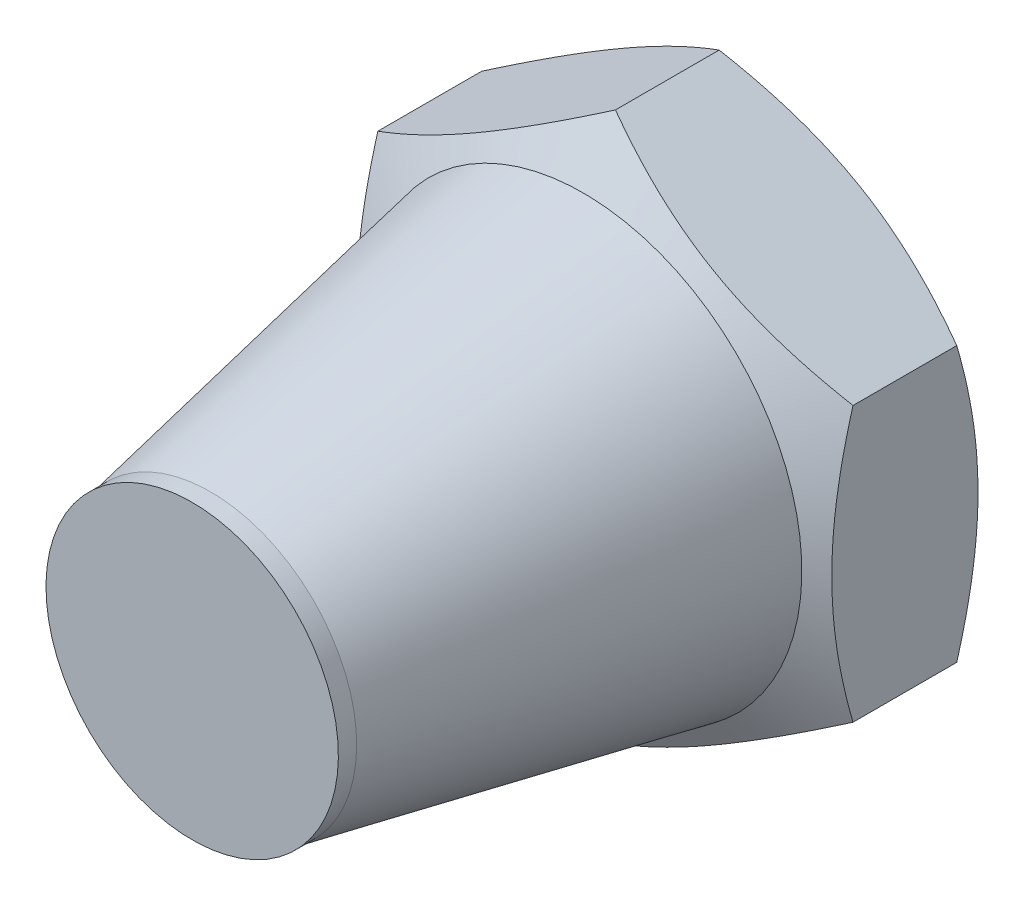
ISO-10303-21;
HEADER;
FILE_DESCRIPTION(('STEP AP214'),'2;1');
FILE_NAME('part.step','',(''),(''),'','','');
FILE_SCHEMA(('AUTOMOTIVE_DESIGN { 1 0 10303 214 1 1 1 1 }'));
ENDSEC;
DATA;
#1=APPLICATION_CONTEXT('core data for automotive mechanical design processes');
#2=APPLICATION_PROTOCOL_DEFINITION('international standard','automotive_design',2000,#1);
#3=PRODUCT_CONTEXT('',#1,'mechanical');
#4=PRODUCT('Part','Part','',(#3));
#5=PRODUCT_RELATED_PRODUCT_CATEGORY('part','',(#4));
#6=PRODUCT_DEFINITION_FORMATION('','',#4);
#7=PRODUCT_DEFINITION_CONTEXT('part definition',#1,'design');
#8=PRODUCT_DEFINITION('design','',#6,#7);
#9=PRODUCT_DEFINITION_SHAPE('','',#8);
#10=(LENGTH_UNIT() NAMED_UNIT(*) SI_UNIT(.MILLI.,.METRE.));
#11=(NAMED_UNIT(*) PLANE_ANGLE_UNIT() SI_UNIT($,.RADIAN.));
#12=(NAMED_UNIT(*) SI_UNIT($,.STERADIAN.) SOLID_ANGLE_UNIT());
#13=UNCERTAINTY_MEASURE_WITH_UNIT(LENGTH_MEASURE(1.E-05),#10,'distance_accuracy_value','');
#14=(GEOMETRIC_REPRESENTATION_CONTEXT(3) GLOBAL_UNCERTAINTY_ASSIGNED_CONTEXT((#13)) GLOBAL_UNIT_ASSIGNED_CONTEXT((#10,
#11,#12)) REPRESENTATION_CONTEXT('',''));
#15=CARTESIAN_POINT('',(0.,0.,0.));
#16=DIRECTION('',(0.,0.,1.));
#17=DIRECTION('',(1.,0.,0.));
#18=AXIS2_PLACEMENT_3D('',#15,#16,#17);
#19=CARTESIAN_POINT('',(0.,0.,2.));
#20=DIRECTION('',(0.,0.,-1.));
#21=DIRECTION('',(0.866025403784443,-0.499999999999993,0.));
#22=AXIS2_PLACEMENT_3D('',#19,#20,#21);
#23=CONICAL_SURFACE('',#22,9.9641016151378,1.0471975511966);
#24=CARTESIAN_POINT('',(0.,0.,4.3002221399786));
#25=DIRECTION('',(0.,0.,-1.));
#26=DIRECTION('',(0.866025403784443,-0.499999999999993,0.));
#27=AXIS2_PLACEMENT_3D('',#24,#25,#26);
#28=CIRCLE('',#27,5.98);
#29=CARTESIAN_POINT('',(5.17883191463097,-2.98999999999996,4.3002221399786));
#30=VERTEX_POINT('',#29);
#31=EDGE_CURVE('E274',#30,#30,#28,.T.);
#32=ORIENTED_EDGE('',*,*,#31,.T.);
#33=EDGE_LOOP('',(#32));
#34=FACE_BOUND('',#33,.T.);
#35=CARTESIAN_POINT('',(-5.50464676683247,10.6836627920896,0.813953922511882));
#36=CARTESIAN_POINT('',(-5.25856626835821,10.5415881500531,0.951906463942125));
#37=CARTESIAN_POINT('',(-5.01192350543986,10.3991888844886,1.08854446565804));
#38=CARTESIAN_POINT('',(-4.517214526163,10.1135685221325,1.35845260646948));
#39=CARTESIAN_POINT('',(-4.26914809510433,9.97034730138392,1.49172222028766));
#40=CARTESIAN_POINT('',(-3.77002670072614,9.68217942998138,1.75481910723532));
#41=CARTESIAN_POINT('',(-3.5189628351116,9.53722763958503,1.88462393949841));
#42=CARTESIAN_POINT('',(-3.01484675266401,9.2461760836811,2.13895929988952));
#43=CARTESIAN_POINT('',(-2.76179462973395,9.10007637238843,2.26349007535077));
#44=CARTESIAN_POINT('',(-2.24505569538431,8.80173700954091,2.50981565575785));
#45=CARTESIAN_POINT('',(-1.98129000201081,8.64945181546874,2.63139101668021));
#46=CARTESIAN_POINT('',(-1.45068168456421,8.34310496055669,2.86540938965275));
#47=CARTESIAN_POINT('',(-1.18383872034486,8.1890431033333,2.97785138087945));
#48=CARTESIAN_POINT('',(-0.647143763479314,7.87918212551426,3.19067263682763));
#49=CARTESIAN_POINT('',(-0.377299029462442,7.72338719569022,3.29107606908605));
#50=CARTESIAN_POINT('',(0.166264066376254,7.40956089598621,3.4766162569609));
#51=CARTESIAN_POINT('',(0.439981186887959,7.25153024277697,3.56175779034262));
#52=CARTESIAN_POINT('',(0.989916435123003,6.93402497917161,3.71225918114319));
#53=CARTESIAN_POINT('',(1.2661121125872,6.77456333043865,3.77772667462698));
#54=CARTESIAN_POINT('',(1.82200305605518,6.45361954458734,3.88518106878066));
#55=CARTESIAN_POINT('',(2.10169797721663,6.29213760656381,3.92717026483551));
#56=CARTESIAN_POINT('',(2.52089047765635,6.05011670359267,3.96975845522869));
#57=CARTESIAN_POINT('',(2.65964585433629,5.970006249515,3.98054959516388));
#58=CARTESIAN_POINT('',(2.93743366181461,5.8096253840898,3.99535095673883));
#59=CARTESIAN_POINT('',(3.07646608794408,5.72935497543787,3.99936129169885));
#60=CARTESIAN_POINT('',(3.35455197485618,5.56880201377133,4.00049782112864));
#61=CARTESIAN_POINT('',(3.4936054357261,5.48851946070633,3.99762398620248));
#62=CARTESIAN_POINT('',(3.77148360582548,5.32808642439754,3.98506477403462));
#63=CARTESIAN_POINT('',(3.91030830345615,5.2479359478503,3.97537906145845));
#64=CARTESIAN_POINT('',(4.24317824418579,5.05575339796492,3.94419318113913));
#65=CARTESIAN_POINT('',(4.43700457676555,4.94384771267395,3.91951007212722));
#66=CARTESIAN_POINT('',(4.8232260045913,4.72086266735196,3.85820420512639));
#67=CARTESIAN_POINT('',(5.01562090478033,4.60978341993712,3.8215798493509));
#68=CARTESIAN_POINT('',(5.59043287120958,4.27791557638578,3.69573612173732));
#69=CARTESIAN_POINT('',(5.97026630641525,4.05861864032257,3.59056847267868));
#70=CARTESIAN_POINT('',(6.53828857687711,3.73067082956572,3.40807580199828));
#71=CARTESIAN_POINT('',(6.72942027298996,3.6203208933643,3.34226066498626));
#72=CARTESIAN_POINT('',(7.10982731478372,3.40069278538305,3.20376518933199));
#73=CARTESIAN_POINT('',(7.29910264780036,3.29141462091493,3.13108480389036));
#74=CARTESIAN_POINT('',(7.67585644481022,3.07389571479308,2.98002751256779));
#75=CARTESIAN_POINT('',(7.86333546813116,2.96565465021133,2.90165244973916));
#76=CARTESIAN_POINT('',(8.23673796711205,2.75007061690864,2.74013098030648));
#77=CARTESIAN_POINT('',(8.42266146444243,2.64272763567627,2.65698464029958));
#78=CARTESIAN_POINT('',(8.87505986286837,2.3815352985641,2.44905554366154));
#79=CARTESIAN_POINT('',(9.14079224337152,2.22811463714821,2.3221222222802));
#80=CARTESIAN_POINT('',(9.66989077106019,1.92263945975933,2.06182235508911));
#81=CARTESIAN_POINT('',(9.93325674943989,1.77058504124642,1.92845535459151));
#82=CARTESIAN_POINT('',(10.4580868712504,1.4675742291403,1.65663156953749));
#83=CARTESIAN_POINT('',(10.7195505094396,1.31661812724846,1.51817348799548));
#84=CARTESIAN_POINT('',(11.2408413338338,1.01565072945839,1.237238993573));
#85=CARTESIAN_POINT('',(11.5006685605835,0.865639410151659,1.09476268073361));
#86=CARTESIAN_POINT('',(12.019282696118,0.566217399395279,0.806400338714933));
#87=CARTESIAN_POINT('',(12.278067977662,0.416807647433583,0.660510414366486));
#88=CARTESIAN_POINT('',(12.7945079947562,0.118640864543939,0.366083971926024));
#89=CARTESIAN_POINT('',(13.0521627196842,-0.0301161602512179,0.217547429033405));
#90=CARTESIAN_POINT('',(13.82363380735,-0.475525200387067,-0.231257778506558));
#91=CARTESIAN_POINT('',(14.3360362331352,-0.771360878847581,-0.534766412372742));
#92=CARTESIAN_POINT('',(15.3127558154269,-1.33527019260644,-1.12056744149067));
#93=CARTESIAN_POINT('',(15.7773029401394,-1.60347660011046,-1.40235093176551));
#94=CARTESIAN_POINT('',(16.7047068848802,-2.13891351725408,-1.9696523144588));
#95=CARTESIAN_POINT('',(17.1675636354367,-2.40614398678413,-2.25517035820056));
#96=CARTESIAN_POINT('',(18.0907213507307,-2.9391293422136,-2.82825869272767));
#97=CARTESIAN_POINT('',(18.5510258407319,-3.20488626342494,-3.11582142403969));
#98=CARTESIAN_POINT('',(19.470562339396,-3.73578090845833,-3.69314970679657));
#99=CARTESIAN_POINT('',(19.9297944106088,-4.00091866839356,-3.98291512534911));
#100=CARTESIAN_POINT('',(20.3886360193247,-4.26583099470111,-4.27349716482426));
#101=B_SPLINE_CURVE_WITH_KNOTS('',3,(#35,#36,#37,#38,#39,#40,#41,#42,#43,#44,#45,#46,#47,#48,
#49,#50,#51,#52,#53,#54,#55,#56,#57,#58,#59,#60,#61,#62,#63,#64,#65,#66,#67,#68,#69,#70,#71,#72,
#73,#74,#75,#76,#77,#78,#79,#80,#81,#82,#83,#84,#85,#86,#87,#88,#89,#90,#91,#92,#93,#94,#95,#96,
#97,#98,#99,#100),.UNSPECIFIED.,.F.,.F.,(4,2,2,2,2,2,2,2,2,2,2,2,2,2,2,2,2,2,2,2,2,2,2,2,2,2,2,
2,2,2,2,2,4),(0.,0.947611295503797,1.89536946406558,2.8482389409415,3.8010636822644,
4.78476621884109,5.76857855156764,6.75038157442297,7.73187670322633,8.70790002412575,
9.68382790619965,10.165457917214,10.6470798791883,11.128703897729,11.6103516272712,
12.285475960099,12.9606906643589,14.3118504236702,15.0027050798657,15.6935644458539,
16.3842012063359,17.074828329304,18.0709060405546,19.0670542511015,20.0634580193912,
21.0598370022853,22.0574144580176,23.0550012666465,25.0498701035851,26.8676185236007,
28.6854408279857,30.4983869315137,32.3112245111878),.UNSPECIFIED.);
#102=CARTESIAN_POINT('',(6.5,3.7527767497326,3.41944341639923));
#103=VERTEX_POINT('',#102);
#104=CARTESIAN_POINT('',(0.,7.50555349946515,3.41944341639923));
#105=VERTEX_POINT('',#104);
#106=EDGE_CURVE('E102',#103,#105,#101,.F.);
#107=ORIENTED_EDGE('',*,*,#106,.T.);
#108=CARTESIAN_POINT('',(0.00019999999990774,7.50566896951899,3.41937674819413));
#109=CARTESIAN_POINT('',(-0.142677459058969,7.42317863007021,3.46699557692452));
#110=CARTESIAN_POINT('',(-0.286087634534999,7.34038072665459,3.5124532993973));
#111=CARTESIAN_POINT('',(-0.574072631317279,7.17411251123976,3.59845131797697));
#112=CARTESIAN_POINT('',(-0.718647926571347,7.09064192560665,3.63898949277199));
#113=CARTESIAN_POINT('',(-1.15468865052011,6.83889369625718,3.7524289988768));
#114=CARTESIAN_POINT('',(-1.4478752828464,6.6696223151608,3.81695219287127));
#115=CARTESIAN_POINT('',(-1.88662374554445,6.41631077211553,3.89261341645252));
#116=CARTESIAN_POINT('',(-2.03087463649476,6.33302748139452,3.91416714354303));
#117=CARTESIAN_POINT('',(-2.32002821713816,6.16608458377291,3.9503096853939));
#118=CARTESIAN_POINT('',(-2.46493084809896,6.0824250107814,3.96489911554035));
#119=CARTESIAN_POINT('',(-2.75498777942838,5.91496056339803,3.98674124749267));
#120=CARTESIAN_POINT('',(-2.90014160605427,5.83115596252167,3.99400227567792));
#121=CARTESIAN_POINT('',(-3.19057533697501,5.66347396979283,4.00103969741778));
#122=CARTESIAN_POINT('',(-3.33585523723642,5.57959658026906,4.0008163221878));
#123=CARTESIAN_POINT('',(-3.73387594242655,5.34979921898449,3.98991654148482));
#124=CARTESIAN_POINT('',(-3.98648646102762,5.20395446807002,3.9716181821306));
#125=CARTESIAN_POINT('',(-4.49002967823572,4.9132336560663,3.91359365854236));
#126=CARTESIAN_POINT('',(-4.74096060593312,4.7683586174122,3.87384766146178));
#127=CARTESIAN_POINT('',(-5.24551722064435,4.47705272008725,3.77449409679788));
#128=CARTESIAN_POINT('',(-5.49907924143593,4.33065861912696,3.714465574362));
#129=CARTESIAN_POINT('',(-6.00242193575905,4.04005357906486,3.57822500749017));
#130=CARTESIAN_POINT('',(-6.25220905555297,3.89583891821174,3.50204496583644));
#131=CARTESIAN_POINT('',(-6.5002,3.75266127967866,3.41937674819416));
#132=B_SPLINE_CURVE_WITH_KNOTS('',3,(#108,#109,#110,#111,#112,#113,#114,#115,#116,#117,#118,
#119,#120,#121,#122,#123,#124,#125,#126,#127,#128,#129,#130,#131),.UNSPECIFIED.,.F.,.F.,(4,2,2,
2,2,2,2,2,2,2,2,4),(0.,0.515105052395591,1.03043143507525,2.06322554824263,2.56697389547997,
3.07067772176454,3.57380860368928,4.07692394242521,4.9527935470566,5.82947446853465,
6.72559912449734,7.61996451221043),.UNSPECIFIED.);
#133=CARTESIAN_POINT('',(-6.5,3.7527767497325,3.41944341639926));
#134=VERTEX_POINT('',#133);
#135=EDGE_CURVE('E93',#105,#134,#132,.T.);
#136=ORIENTED_EDGE('',*,*,#135,.T.);
#137=CARTESIAN_POINT('',(-6.5,3.75300768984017,3.41937674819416));
#138=CARTESIAN_POINT('',(-6.5,3.58802701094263,3.46699557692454));
#139=CARTESIAN_POINT('',(-6.5,3.42243120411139,3.51245329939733));
#140=CARTESIAN_POINT('',(-6.5,3.08989477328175,3.59845131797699));
#141=CARTESIAN_POINT('',(-6.5,2.92295360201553,3.63898949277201));
#142=CARTESIAN_POINT('',(-6.5,2.41945714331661,3.75242899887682));
#143=CARTESIAN_POINT('',(-6.5,2.08091438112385,3.81695219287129));
#144=CARTESIAN_POINT('',(-6.5,1.57429129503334,3.89261341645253));
#145=CARTESIAN_POINT('',(-6.5,1.40772471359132,3.91416714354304));
#146=CARTESIAN_POINT('',(-6.5,1.07383891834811,3.9503096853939));
#147=CARTESIAN_POINT('',(-6.5,0.9065197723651,3.96489911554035));
#148=CARTESIAN_POINT('',(-6.5,0.571590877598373,3.98674124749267));
#149=CARTESIAN_POINT('',(-6.5,0.403981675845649,3.99400227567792));
#150=CARTESIAN_POINT('',(-6.5,0.0686176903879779,4.00103969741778));
#151=CARTESIAN_POINT('',(-6.5,-0.0991370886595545,4.0008163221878));
#152=CARTESIAN_POINT('',(-6.5,-0.558731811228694,3.98991654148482));
#153=CARTESIAN_POINT('',(-6.5,-0.850421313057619,3.97161818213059));
#154=CARTESIAN_POINT('',(-6.5,-1.43186293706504,3.91359365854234));
#155=CARTESIAN_POINT('',(-6.5,-1.72161301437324,3.87384766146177));
#156=CARTESIAN_POINT('',(-6.5,-2.30422480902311,3.77449409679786));
#157=CARTESIAN_POINT('',(-6.5,-2.59701301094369,3.71446557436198));
#158=CARTESIAN_POINT('',(-6.5,-3.17822309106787,3.57822500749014));
#159=CARTESIAN_POINT('',(-6.5,-3.46665241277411,3.50204496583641));
#160=CARTESIAN_POINT('',(-6.5,-3.75300768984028,3.41937674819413));
#161=B_SPLINE_CURVE_WITH_KNOTS('',3,(#137,#138,#139,#140,#141,#142,#143,#144,#145,#146,#147,
#148,#149,#150,#151,#152,#153,#154,#155,#156,#157,#158,#159,#160),.UNSPECIFIED.,.F.,.F.,(4,2,2,
2,2,2,2,2,2,2,2,4),(0.,0.515105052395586,1.03043143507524,2.06322554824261,2.56697389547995,
3.07067772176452,3.57380860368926,4.07692394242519,4.95279354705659,5.82947446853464,
6.72559912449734,7.61996451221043),.UNSPECIFIED.);
#162=CARTESIAN_POINT('',(-6.5,-3.7527767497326,3.41944341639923));
#163=VERTEX_POINT('',#162);
#164=EDGE_CURVE('E82',#134,#163,#161,.T.);
#165=ORIENTED_EDGE('',*,*,#164,.T.);
#166=CARTESIAN_POINT('',(-12.0046467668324,-0.57466745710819,0.813953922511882));
#167=CARTESIAN_POINT('',(-11.7585662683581,-0.716742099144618,0.951906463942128));
#168=CARTESIAN_POINT('',(-11.5119235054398,-0.859141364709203,1.08854446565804));
#169=CARTESIAN_POINT('',(-11.0172145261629,-1.14476172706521,1.35845260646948));
#170=CARTESIAN_POINT('',(-10.7691480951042,-1.28798294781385,1.49172222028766));
#171=CARTESIAN_POINT('',(-10.270026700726,-1.57615081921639,1.75481910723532));
#172=CARTESIAN_POINT('',(-10.0189628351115,-1.72110260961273,1.88462393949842));
#173=CARTESIAN_POINT('',(-9.51484675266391,-2.01215416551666,2.13895929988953));
#174=CARTESIAN_POINT('',(-9.26179462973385,-2.15825387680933,2.26349007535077));
#175=CARTESIAN_POINT('',(-8.74505569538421,-2.45659323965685,2.50981565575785));
#176=CARTESIAN_POINT('',(-8.48129000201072,-2.60887843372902,2.63139101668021));
#177=CARTESIAN_POINT('',(-7.95068168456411,-2.91522528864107,2.86540938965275));
#178=CARTESIAN_POINT('',(-7.68383872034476,-3.06928714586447,2.97785138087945));
#179=CARTESIAN_POINT('',(-7.14714376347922,-3.3791481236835,3.19067263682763));
#180=CARTESIAN_POINT('',(-6.87729902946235,-3.53494305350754,3.29107606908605));
#181=CARTESIAN_POINT('',(-6.33373593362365,-3.84876935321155,3.4766162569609));
#182=CARTESIAN_POINT('',(-6.06001881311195,-4.00680000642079,3.56175779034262));
#183=CARTESIAN_POINT('',(-5.51008356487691,-4.32430527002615,3.71225918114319));
#184=CARTESIAN_POINT('',(-5.23388788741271,-4.48376691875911,3.77772667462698));
#185=CARTESIAN_POINT('',(-4.67799694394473,-4.80471070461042,3.88518106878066));
#186=CARTESIAN_POINT('',(-4.39830202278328,-4.96619264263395,3.92717026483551));
#187=CARTESIAN_POINT('',(-3.97910952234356,-5.20821354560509,3.96975845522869));
#188=CARTESIAN_POINT('',(-3.84035414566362,-5.28832399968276,3.98054959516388));
#189=CARTESIAN_POINT('',(-3.5625663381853,-5.44870486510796,3.99535095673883));
#190=CARTESIAN_POINT('',(-3.42353391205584,-5.52897527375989,3.99936129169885));
#191=CARTESIAN_POINT('',(-3.14544802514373,-5.68952823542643,4.00049782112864));
#192=CARTESIAN_POINT('',(-3.00639456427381,-5.76981078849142,3.99762398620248));
#193=CARTESIAN_POINT('',(-2.72851639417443,-5.93024382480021,3.98506477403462));
#194=CARTESIAN_POINT('',(-2.58969169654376,-6.01039430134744,3.97537906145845));
#195=CARTESIAN_POINT('',(-2.25682175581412,-6.20257685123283,3.94419318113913));
#196=CARTESIAN_POINT('',(-2.06299542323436,-6.3144825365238,3.91951007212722));
#197=CARTESIAN_POINT('',(-1.67677399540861,-6.53746758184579,3.85820420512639));
#198=CARTESIAN_POINT('',(-1.48437909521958,-6.64854682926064,3.8215798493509));
#199=CARTESIAN_POINT('',(-0.909567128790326,-6.98041467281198,3.69573612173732));
#200=CARTESIAN_POINT('',(-0.529733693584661,-7.19971160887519,3.59056847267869));
#201=CARTESIAN_POINT('',(0.0382885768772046,-7.52765941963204,3.40807580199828));
#202=CARTESIAN_POINT('',(0.229420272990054,-7.63800935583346,3.34226066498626));
#203=CARTESIAN_POINT('',(0.609827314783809,-7.85763746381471,3.20376518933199));
#204=CARTESIAN_POINT('',(0.799102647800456,-7.96691562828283,3.13108480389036));
#205=CARTESIAN_POINT('',(1.17585644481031,-8.18443453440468,2.98002751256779));
#206=CARTESIAN_POINT('',(1.36333546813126,-8.29267559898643,2.90165244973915));
#207=CARTESIAN_POINT('',(1.73673796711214,-8.50825963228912,2.74013098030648));
#208=CARTESIAN_POINT('',(1.92266146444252,-8.61560261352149,2.65698464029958));
#209=CARTESIAN_POINT('',(2.37505986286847,-8.87679495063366,2.44905554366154));
#210=CARTESIAN_POINT('',(2.64079224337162,-9.03021561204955,2.3221222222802));
#211=CARTESIAN_POINT('',(3.16989077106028,-9.33569078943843,2.06182235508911));
#212=CARTESIAN_POINT('',(3.43325674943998,-9.48774520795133,1.92845535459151));
#213=CARTESIAN_POINT('',(3.95808687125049,-9.79075602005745,1.65663156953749));
#214=CARTESIAN_POINT('',(4.21955050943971,-9.94171212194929,1.51817348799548));
#215=CARTESIAN_POINT('',(4.74084133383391,-10.2426795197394,1.237238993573));
#216=CARTESIAN_POINT('',(5.00066856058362,-10.3926908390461,1.09476268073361));
#217=CARTESIAN_POINT('',(5.51928269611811,-10.6921128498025,0.806400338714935));
#218=CARTESIAN_POINT('',(5.77806797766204,-10.8415226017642,0.660510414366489));
#219=CARTESIAN_POINT('',(6.29450799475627,-11.1396893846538,0.366083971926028));
#220=CARTESIAN_POINT('',(6.55216271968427,-11.288446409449,0.217547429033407));
#221=CARTESIAN_POINT('',(7.32363380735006,-11.7338554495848,-0.231257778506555));
#222=CARTESIAN_POINT('',(7.83603623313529,-12.0296911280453,-0.534766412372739));
#223=CARTESIAN_POINT('',(8.81275581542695,-12.5936004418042,-1.12056744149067));
#224=CARTESIAN_POINT('',(9.27730294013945,-12.8618068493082,-1.40235093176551));
#225=CARTESIAN_POINT('',(10.2047068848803,-13.3972437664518,-1.96965231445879));
#226=CARTESIAN_POINT('',(10.6675636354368,-13.6644742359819,-2.25517035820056));
#227=CARTESIAN_POINT('',(11.5907213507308,-14.1974595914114,-2.82825869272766));
#228=CARTESIAN_POINT('',(12.0510258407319,-14.4632165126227,-3.11582142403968));
#229=CARTESIAN_POINT('',(12.970562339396,-14.9941111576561,-3.69314970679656));
#230=CARTESIAN_POINT('',(13.4297944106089,-15.2592489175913,-3.9829151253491));
#231=CARTESIAN_POINT('',(13.8886360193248,-15.5241612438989,-4.27349716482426));
#232=B_SPLINE_CURVE_WITH_KNOTS('',3,(#166,#167,#168,#169,#170,#171,#172,#173,#174,#175,#176,
#177,#178,#179,#180,#181,#182,#183,#184,#185,#186,#187,#188,#189,#190,#191,#192,#193,#194,#195,
#196,#197,#198,#199,#200,#201,#202,#203,#204,#205,#206,#207,#208,#209,#210,#211,#212,#213,#214,
#215,#216,#217,#218,#219,#220,#221,#222,#223,#224,#225,#226,#227,#228,#229,#230,#231),
.UNSPECIFIED.,.F.,.F.,(4,2,2,2,2,2,2,2,2,2,2,2,2,2,2,2,2,2,2,2,2,2,2,2,2,2,2,2,2,2,2,2,4),(0.,
0.947611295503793,1.89536946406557,2.8482389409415,3.80106368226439,4.78476621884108,
5.76857855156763,6.75038157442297,7.73187670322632,8.70790002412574,9.68382790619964,
10.165457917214,10.6470798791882,11.128703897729,11.6103516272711,12.285475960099,
12.9606906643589,14.3118504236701,15.0027050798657,15.6935644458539,16.3842012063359,
17.074828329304,18.0709060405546,19.0670542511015,20.0634580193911,21.0598370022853,
22.0574144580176,23.0550012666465,25.0498701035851,26.8676185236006,28.6854408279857,
30.4983869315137,32.3112245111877),.UNSPECIFIED.);
#233=CARTESIAN_POINT('',(0.,-7.50555349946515,3.41944341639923));
#234=VERTEX_POINT('',#233);
#235=EDGE_CURVE('E228',#163,#234,#232,.T.);
#236=ORIENTED_EDGE('',*,*,#235,.T.);
#237=CARTESIAN_POINT('',(-0.00019999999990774,-7.50566896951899,3.41937674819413));
#238=CARTESIAN_POINT('',(0.142677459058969,-7.42317863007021,3.46699557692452));
#239=CARTESIAN_POINT('',(0.286087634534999,-7.34038072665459,3.5124532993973));
#240=CARTESIAN_POINT('',(0.574072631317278,-7.17411251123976,3.59845131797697));
#241=CARTESIAN_POINT('',(0.718647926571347,-7.09064192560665,3.63898949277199));
#242=CARTESIAN_POINT('',(1.15468865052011,-6.83889369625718,3.7524289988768));
#243=CARTESIAN_POINT('',(1.44787528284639,-6.6696223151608,3.81695219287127));
#244=CARTESIAN_POINT('',(1.88662374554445,-6.41631077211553,3.89261341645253));
#245=CARTESIAN_POINT('',(2.03087463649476,-6.33302748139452,3.91416714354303));
#246=CARTESIAN_POINT('',(2.32002821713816,-6.16608458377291,3.9503096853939));
#247=CARTESIAN_POINT('',(2.46493084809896,-6.0824250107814,3.96489911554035));
#248=CARTESIAN_POINT('',(2.75498777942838,-5.91496056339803,3.98674124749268));
#249=CARTESIAN_POINT('',(2.90014160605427,-5.83115596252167,3.99400227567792));
#250=CARTESIAN_POINT('',(3.19057533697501,-5.66347396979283,4.00103969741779));
#251=CARTESIAN_POINT('',(3.33585523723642,-5.57959658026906,4.0008163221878));
#252=CARTESIAN_POINT('',(3.73387594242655,-5.34979921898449,3.98991654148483));
#253=CARTESIAN_POINT('',(3.98648646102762,-5.20395446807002,3.9716181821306));
#254=CARTESIAN_POINT('',(4.49002967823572,-4.9132336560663,3.91359365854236));
#255=CARTESIAN_POINT('',(4.74096060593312,-4.7683586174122,3.87384766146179));
#256=CARTESIAN_POINT('',(5.24551722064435,-4.47705272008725,3.77449409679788));
#257=CARTESIAN_POINT('',(5.49907924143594,-4.33065861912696,3.71446557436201));
#258=CARTESIAN_POINT('',(6.00242193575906,-4.04005357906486,3.57822500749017));
#259=CARTESIAN_POINT('',(6.25220905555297,-3.89583891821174,3.50204496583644));
#260=CARTESIAN_POINT('',(6.5002,-3.75266127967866,3.41937674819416));
#261=B_SPLINE_CURVE_WITH_KNOTS('',3,(#237,#238,#239,#240,#241,#242,#243,#244,#245,#246,#247,
#248,#249,#250,#251,#252,#253,#254,#255,#256,#257,#258,#259,#260),.UNSPECIFIED.,.F.,.F.,(4,2,2,
2,2,2,2,2,2,2,2,4),(0.,0.515105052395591,1.03043143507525,2.06322554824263,2.56697389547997,
3.07067772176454,3.57380860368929,4.07692394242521,4.9527935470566,5.82947446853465,
6.72559912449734,7.61996451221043),.UNSPECIFIED.);
#262=CARTESIAN_POINT('',(6.5,-3.7527767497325,3.41944341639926));
#263=VERTEX_POINT('',#262);
#264=EDGE_CURVE('E215',#234,#263,#261,.T.);
#265=ORIENTED_EDGE('',*,*,#264,.T.);
#266=CARTESIAN_POINT('',(6.5,-3.75300768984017,3.41937674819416));
#267=CARTESIAN_POINT('',(6.5,-3.58802701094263,3.46699557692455));
#268=CARTESIAN_POINT('',(6.5,-3.42243120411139,3.51245329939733));
#269=CARTESIAN_POINT('',(6.5,-3.08989477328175,3.59845131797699));
#270=CARTESIAN_POINT('',(6.5,-2.92295360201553,3.63898949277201));
#271=CARTESIAN_POINT('',(6.5,-2.41945714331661,3.75242899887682));
#272=CARTESIAN_POINT('',(6.5,-2.08091438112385,3.81695219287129));
#273=CARTESIAN_POINT('',(6.5,-1.57429129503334,3.89261341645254));
#274=CARTESIAN_POINT('',(6.5,-1.40772471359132,3.91416714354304));
#275=CARTESIAN_POINT('',(6.5,-1.07383891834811,3.95030968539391));
#276=CARTESIAN_POINT('',(6.5,-0.9065197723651,3.96489911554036));
#277=CARTESIAN_POINT('',(6.5,-0.571590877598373,3.98674124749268));
#278=CARTESIAN_POINT('',(6.5,-0.403981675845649,3.99400227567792));
#279=CARTESIAN_POINT('',(6.5,-0.0686176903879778,4.00103969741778));
#280=CARTESIAN_POINT('',(6.5,0.0991370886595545,4.0008163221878));
#281=CARTESIAN_POINT('',(6.5,0.558731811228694,3.98991654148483));
#282=CARTESIAN_POINT('',(6.5,0.850421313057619,3.9716181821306));
#283=CARTESIAN_POINT('',(6.5,1.43186293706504,3.91359365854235));
#284=CARTESIAN_POINT('',(6.5,1.72161301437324,3.87384766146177));
#285=CARTESIAN_POINT('',(6.5,2.30422480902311,3.77449409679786));
#286=CARTESIAN_POINT('',(6.5,2.59701301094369,3.71446557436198));
#287=CARTESIAN_POINT('',(6.5,3.17822309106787,3.57822500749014));
#288=CARTESIAN_POINT('',(6.5,3.46665241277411,3.50204496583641));
#289=CARTESIAN_POINT('',(6.5,3.75300768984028,3.41937674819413));
#290=B_SPLINE_CURVE_WITH_KNOTS('',3,(#266,#267,#268,#269,#270,#271,#272,#273,#274,#275,#276,
#277,#278,#279,#280,#281,#282,#283,#284,#285,#286,#287,#288,#289),.UNSPECIFIED.,.F.,.F.,(4,2,2,
2,2,2,2,2,2,2,2,4),(0.,0.515105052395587,1.03043143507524,2.06322554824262,2.56697389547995,
3.07067772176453,3.57380860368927,4.07692394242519,4.95279354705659,5.82947446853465,
6.72559912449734,7.61996451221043),.UNSPECIFIED.);
#291=EDGE_CURVE('E188',#263,#103,#290,.T.);
#292=ORIENTED_EDGE('',*,*,#291,.T.);
#293=EDGE_LOOP('',(#107,#136,#165,#236,#265,#292));
#294=FACE_BOUND('',#293,.T.);
#295=ADVANCED_FACE('F14',(#34,#294),#23,.T.);
#296=CARTESIAN_POINT('',(0.,0.,15.));
#297=DIRECTION('',(0.,0.,1.));
#298=DIRECTION('',(-0.866025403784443,0.499999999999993,0.));
#299=AXIS2_PLACEMENT_3D('',#296,#297,#298);
#300=PLANE('',#299);
#301=CARTESIAN_POINT('',(0.,0.,15.));
#302=DIRECTION('',(0.,0.,-1.));
#303=DIRECTION('',(0.866025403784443,-0.499999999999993,0.));
#304=AXIS2_PLACEMENT_3D('',#301,#302,#303);
#305=CIRCLE('',#304,4.);
#306=CARTESIAN_POINT('',(3.46410161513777,-1.99999999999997,15.));
#307=VERTEX_POINT('',#306);
#308=EDGE_CURVE('E9',#307,#307,#305,.T.);
#309=ORIENTED_EDGE('',*,*,#308,.F.);
#310=EDGE_LOOP('',(#309));
#311=FACE_BOUND('',#310,.T.);
#312=ADVANCED_FACE('F16',(#311),#300,.T.);
#313=CARTESIAN_POINT('',(0.,0.,11.4235));
#314=DIRECTION('',(0.,0.,-1.));
#315=DIRECTION('',(0.866025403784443,-0.499999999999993,0.));
#316=AXIS2_PLACEMENT_3D('',#313,#314,#315);
#317=CYLINDRICAL_SURFACE('',#316,4.);
#318=ORIENTED_EDGE('',*,*,#308,.T.);
#319=EDGE_LOOP('',(#318));
#320=FACE_BOUND('',#319,.T.);
#321=CARTESIAN_POINT('',(0.,0.,14.5));
#322=DIRECTION('',(0.,0.,-1.));
#323=DIRECTION('',(0.866025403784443,-0.499999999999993,0.));
#324=AXIS2_PLACEMENT_3D('',#321,#322,#323);
#325=CIRCLE('',#324,4.);
#326=CARTESIAN_POINT('',(3.46410161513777,-1.99999999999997,14.5));
#327=VERTEX_POINT('',#326);
#328=EDGE_CURVE('E22',#327,#327,#325,.T.);
#329=ORIENTED_EDGE('',*,*,#328,.F.);
#330=EDGE_LOOP('',(#329));
#331=FACE_BOUND('',#330,.T.);
#332=ADVANCED_FACE('F301',(#320,#331),#317,.T.);
#333=CARTESIAN_POINT('',(0.,0.,4.3002221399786));
#334=DIRECTION('',(0.,0.,-1.));
#335=DIRECTION('',(0.866025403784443,-0.499999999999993,0.));
#336=AXIS2_PLACEMENT_3D('',#333,#334,#335);
#337=CONICAL_SURFACE('',#336,5.98,0.191737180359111);
#338=ORIENTED_EDGE('',*,*,#328,.T.);
#339=EDGE_LOOP('',(#338));
#340=FACE_BOUND('',#339,.T.);
#341=ORIENTED_EDGE('',*,*,#31,.F.);
#342=EDGE_LOOP('',(#341));
#343=FACE_BOUND('',#342,.T.);
#344=ADVANCED_FACE('F131',(#340,#343),#337,.T.);
#345=CARTESIAN_POINT('',(0.,7.50555349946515,-15.));
#346=DIRECTION('',(-0.500000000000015,0.866025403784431,0.));
#347=DIRECTION('',(-0.866025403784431,-0.500000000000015,0.));
#348=AXIS2_PLACEMENT_3D('',#345,#346,#347);
#349=PLANE('',#348);
#350=DIRECTION('',(0.,0.,1.));
#351=VECTOR('',#350,1.);
#352=CARTESIAN_POINT('',(0.,7.50555349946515,-15.));
#353=LINE('',#352,#351);
#354=CARTESIAN_POINT('',(0.,7.50555349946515,0.580556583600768));
#355=VERTEX_POINT('',#354);
#356=EDGE_CURVE('E258',#355,#105,#353,.T.);
#357=ORIENTED_EDGE('',*,*,#356,.F.);
#358=CARTESIAN_POINT('',(-6.5002,3.75266127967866,0.580623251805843));
#359=CARTESIAN_POINT('',(-6.35732254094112,3.83515161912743,0.533004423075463));
#360=CARTESIAN_POINT('',(-6.21391236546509,3.91794952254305,0.487546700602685));
#361=CARTESIAN_POINT('',(-5.92592736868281,4.08421773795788,0.401548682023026));
#362=CARTESIAN_POINT('',(-5.78135207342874,4.16768832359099,0.361010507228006));
#363=CARTESIAN_POINT('',(-5.34531134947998,4.41943655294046,0.247571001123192));
#364=CARTESIAN_POINT('',(-5.05212471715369,4.58870793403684,0.183047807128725));
#365=CARTESIAN_POINT('',(-4.61337625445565,4.8420194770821,0.10738658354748));
#366=CARTESIAN_POINT('',(-4.46912536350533,4.92530276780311,0.0858328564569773));
#367=CARTESIAN_POINT('',(-4.17997178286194,5.09224566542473,0.0496903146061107));
#368=CARTESIAN_POINT('',(-4.03506915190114,5.17590523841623,0.0351008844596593));
#369=CARTESIAN_POINT('',(-3.74501222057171,5.3433696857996,0.013258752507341));
#370=CARTESIAN_POINT('',(-3.59985839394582,5.42717428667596,0.00599772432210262));
#371=CARTESIAN_POINT('',(-3.30942466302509,5.59485627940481,-0.00103969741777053));
#372=CARTESIAN_POINT('',(-3.16414476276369,5.67873366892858,-0.000816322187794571));
#373=CARTESIAN_POINT('',(-2.76612405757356,5.90853103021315,0.0100834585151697));
#374=CARTESIAN_POINT('',(-2.51351353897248,6.05437578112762,0.028381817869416));
#375=CARTESIAN_POINT('',(-2.00997032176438,6.34509659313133,0.0864063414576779));
#376=CARTESIAN_POINT('',(-1.75903939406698,6.48997163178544,0.126152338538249));
#377=CARTESIAN_POINT('',(-1.25448277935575,6.78127752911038,0.225505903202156));
#378=CARTESIAN_POINT('',(-1.00092075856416,6.92767163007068,0.285534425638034));
#379=CARTESIAN_POINT('',(-0.497578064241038,7.21827667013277,0.421774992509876));
#380=CARTESIAN_POINT('',(-0.247790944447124,7.3624913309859,0.4979550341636));
#381=CARTESIAN_POINT('',(0.00019999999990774,7.50566896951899,0.580623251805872));
#382=B_SPLINE_CURVE_WITH_KNOTS('',3,(#358,#359,#360,#361,#362,#363,#364,#365,#366,#367,#368,
#369,#370,#371,#372,#373,#374,#375,#376,#377,#378,#379,#380,#381),.UNSPECIFIED.,.F.,.F.,(4,2,2,
2,2,2,2,2,2,2,2,4),(0.,0.515105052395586,1.03043143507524,2.06322554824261,2.56697389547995,
3.07067772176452,3.57380860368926,4.07692394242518,4.95279354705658,5.82947446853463,
6.72559912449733,7.61996451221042),.UNSPECIFIED.);
#383=CARTESIAN_POINT('',(-3.25000000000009,5.6291651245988,0.));
#384=VERTEX_POINT('',#383);
#385=EDGE_CURVE('E109',#384,#355,#382,.T.);
#386=ORIENTED_EDGE('',*,*,#385,.F.);
#387=CARTESIAN_POINT('',(-6.5,3.7527767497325,0.580556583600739));
#388=VERTEX_POINT('',#387);
#389=EDGE_CURVE('E96',#388,#384,#382,.T.);
#390=ORIENTED_EDGE('',*,*,#389,.F.);
#391=DIRECTION('',(0.,0.,1.));
#392=VECTOR('',#391,1.);
#393=CARTESIAN_POINT('',(-6.5,3.7527767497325,-15.));
#394=LINE('',#393,#392);
#395=EDGE_CURVE('E35',#388,#134,#394,.T.);
#396=ORIENTED_EDGE('',*,*,#395,.T.);
#397=ORIENTED_EDGE('',*,*,#135,.F.);
#398=EDGE_LOOP('',(#357,#386,#390,#396,#397));
#399=FACE_BOUND('',#398,.T.);
#400=ADVANCED_FACE('F92',(#399),#349,.T.);
#401=CARTESIAN_POINT('',(6.5,3.7527767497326,-15.));
#402=DIRECTION('',(0.499999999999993,0.866025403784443,0.));
#403=DIRECTION('',(-0.866025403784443,0.499999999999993,0.));
#404=AXIS2_PLACEMENT_3D('',#401,#402,#403);
#405=PLANE('',#404);
#406=DIRECTION('',(0.,0.,1.));
#407=VECTOR('',#406,1.);
#408=CARTESIAN_POINT('',(6.5,3.7527767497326,-15.));
#409=LINE('',#408,#407);
#410=CARTESIAN_POINT('',(6.5,3.7527767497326,0.580556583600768));
#411=VERTEX_POINT('',#410);
#412=EDGE_CURVE('E255',#411,#103,#409,.T.);
#413=ORIENTED_EDGE('',*,*,#412,.F.);
#414=CARTESIAN_POINT('',(-5.54115218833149,10.7047392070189,3.20652898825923));
#415=CARTESIAN_POINT('',(-5.29477516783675,10.5624933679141,3.06824212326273));
#416=CARTESIAN_POINT('',(-5.04783912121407,10.4199247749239,2.93126086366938));
#417=CARTESIAN_POINT('',(-4.55255194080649,10.1339705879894,2.66064242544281));
#418=CARTESIAN_POINT('',(-4.30420059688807,9.99058487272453,2.5270057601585));
#419=CARTESIAN_POINT('',(-3.80453528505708,9.70210297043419,2.26315208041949));
#420=CARTESIAN_POINT('',(-3.55321258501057,9.55700174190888,2.13295703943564));
#421=CARTESIAN_POINT('',(-3.04858964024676,9.26565754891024,1.8778010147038));
#422=CARTESIAN_POINT('',(-2.79528948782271,9.11941463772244,1.75283978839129));
#423=CARTESIAN_POINT('',(-2.27788742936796,8.82069241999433,1.50550497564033));
#424=CARTESIAN_POINT('',(-2.01370538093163,8.66816684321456,1.38335372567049));
#425=CARTESIAN_POINT('',(-1.48227292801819,8.36134417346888,1.14812603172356));
#426=CARTESIAN_POINT('',(-1.21502218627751,8.20704688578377,1.03505059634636));
#427=CARTESIAN_POINT('',(-0.677508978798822,7.89671349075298,0.820891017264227));
#428=CARTESIAN_POINT('',(-0.407253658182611,7.74068150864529,0.71978319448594));
#429=CARTESIAN_POINT('',(0.137136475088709,7.42637771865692,0.532757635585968));
#430=CARTESIAN_POINT('',(0.41127005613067,7.26810662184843,0.446835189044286));
#431=CARTESIAN_POINT('',(0.962017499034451,6.95013243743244,0.294716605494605));
#432=CARTESIAN_POINT('',(1.23860819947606,6.79044272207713,0.228410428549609));
#433=CARTESIAN_POINT('',(1.79533222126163,6.46901795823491,0.119232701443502));
#434=CARTESIAN_POINT('',(2.075465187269,6.30728311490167,0.0763588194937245));
#435=CARTESIAN_POINT('',(2.49534082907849,6.0648678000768,0.03246601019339));
#436=CARTESIAN_POINT('',(2.63431772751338,5.98462945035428,0.0212465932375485));
#437=CARTESIAN_POINT('',(2.91256414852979,5.82398380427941,0.00560203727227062));
#438=CARTESIAN_POINT('',(3.05183366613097,5.74357651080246,0.00117678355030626));
#439=CARTESIAN_POINT('',(3.33040824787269,5.58274140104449,-0.000766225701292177));
#440=CARTESIAN_POINT('',(3.46971331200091,5.50231358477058,0.00171601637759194));
#441=CARTESIAN_POINT('',(3.74810781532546,5.34158244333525,0.0135243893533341));
#442=CARTESIAN_POINT('',(3.8871972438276,5.26127912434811,0.0228508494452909));
#443=CARTESIAN_POINT('',(4.21963736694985,5.06934472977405,0.0531229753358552));
#444=CARTESIAN_POINT('',(4.41277894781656,4.95783438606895,0.0771985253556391));
#445=CARTESIAN_POINT('',(4.79765951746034,4.73562348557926,0.137250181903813));
#446=CARTESIAN_POINT('',(4.98939831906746,4.62492303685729,0.17322784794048));
#447=CARTESIAN_POINT('',(5.56227463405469,4.29417274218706,0.297109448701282));
#448=CARTESIAN_POINT('',(5.94086491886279,4.07559353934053,0.400940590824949));
#449=CARTESIAN_POINT('',(6.50702481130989,3.74872097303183,0.581447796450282));
#450=CARTESIAN_POINT('',(6.6975208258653,3.63873804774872,0.646593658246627));
#451=CARTESIAN_POINT('',(7.07666370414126,3.41983980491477,0.783766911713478));
#452=CARTESIAN_POINT('',(7.26531055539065,3.31092449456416,0.855794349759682));
#453=CARTESIAN_POINT('',(7.64081231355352,3.09412845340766,1.00556559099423));
#454=CARTESIAN_POINT('',(7.82766776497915,2.98624740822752,1.08330759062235));
#455=CARTESIAN_POINT('',(8.19982403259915,2.77138288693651,1.24358180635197));
#456=CARTESIAN_POINT('',(8.38512486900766,2.66439939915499,1.32611396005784));
#457=CARTESIAN_POINT('',(8.82994392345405,2.4075829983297,1.52979204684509));
#458=CARTESIAN_POINT('',(9.08878329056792,2.25814202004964,1.65291133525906));
#459=CARTESIAN_POINT('',(9.60418751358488,1.96057325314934,1.90536084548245));
#460=CARTESIAN_POINT('',(9.86075221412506,1.81244555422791,2.03469148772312));
#461=CARTESIAN_POINT('',(10.3720363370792,1.51725552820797,2.29828873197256));
#462=CARTESIAN_POINT('',(10.6267553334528,1.37019344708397,2.43255643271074));
#463=CARTESIAN_POINT('',(11.1346169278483,1.07697941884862,2.70501702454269));
#464=CARTESIAN_POINT('',(11.387759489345,0.930827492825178,2.84321000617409));
#465=CARTESIAN_POINT('',(11.8930170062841,0.639116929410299,3.12292631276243));
#466=CARTESIAN_POINT('',(12.1451304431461,0.493559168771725,3.26445328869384));
#467=CARTESIAN_POINT('',(12.6482508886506,0.203082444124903,3.55010805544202));
#468=CARTESIAN_POINT('',(12.8992578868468,0.0581634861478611,3.69423587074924));
#469=CARTESIAN_POINT('',(13.6508155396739,-0.375748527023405,4.12977253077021));
#470=CARTESIAN_POINT('',(14.1499773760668,-0.66393974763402,4.42437620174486));
#471=CARTESIAN_POINT('',(15.1023905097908,-1.21381572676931,4.99368726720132));
#472=CARTESIAN_POINT('',(15.5558642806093,-1.4756289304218,5.26790069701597));
#473=CARTESIAN_POINT('',(16.4611277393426,-1.99828303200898,5.82005580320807));
#474=CARTESIAN_POINT('',(16.9129173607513,-2.25912389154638,6.09799762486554));
#475=CARTESIAN_POINT('',(17.813986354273,-2.77935631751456,6.65596618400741));
#476=CARTESIAN_POINT('',(18.2632692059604,-3.03874989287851,6.93598544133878));
#477=CARTESIAN_POINT('',(19.1607624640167,-3.55691786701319,7.49823452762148));
#478=CARTESIAN_POINT('',(19.6089729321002,-3.81569230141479,7.78046422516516));
#479=CARTESIAN_POINT('',(20.0567911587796,-4.0742402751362,8.06351575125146));
#480=B_SPLINE_CURVE_WITH_KNOTS('',3,(#414,#415,#416,#417,#418,#419,#420,#421,#422,#423,#424,
#425,#426,#427,#428,#429,#430,#431,#432,#433,#434,#435,#436,#437,#438,#439,#440,#441,#442,#443,
#444,#445,#446,#447,#448,#449,#450,#451,#452,#453,#454,#455,#456,#457,#458,#459,#460,#461,#462,
#463,#464,#465,#466,#467,#468,#469,#470,#471,#472,#473,#474,#475,#476,#477,#478,#479),
.UNSPECIFIED.,.F.,.F.,(4,2,2,2,2,2,2,2,2,2,2,2,2,2,2,2,2,2,2,2,2,2,2,2,2,2,2,2,2,2,2,2,4),(0.,
0.948973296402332,1.89809136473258,2.85225848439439,3.80638133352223,4.79206603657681,
5.77786012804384,6.76166991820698,7.74517399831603,8.72305155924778,9.70083179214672,
10.1833150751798,10.6657902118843,11.1482651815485,11.6307633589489,12.3033341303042,
12.9759930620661,14.3220280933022,15.0101990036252,15.6983745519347,16.3863338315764,
17.0742841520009,18.043929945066,19.0136414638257,19.9835701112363,20.9535211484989,
21.9245888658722,22.8956657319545,24.8375327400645,26.6107620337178,28.3840606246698,
30.1526583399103,31.9211517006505),.UNSPECIFIED.);
#481=CARTESIAN_POINT('',(3.24999999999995,5.62916512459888,0.));
#482=VERTEX_POINT('',#481);
#483=EDGE_CURVE('E180',#482,#411,#480,.T.);
#484=ORIENTED_EDGE('',*,*,#483,.F.);
#485=EDGE_CURVE('E187',#355,#482,#480,.T.);
#486=ORIENTED_EDGE('',*,*,#485,.F.);
#487=ORIENTED_EDGE('',*,*,#356,.T.);
#488=ORIENTED_EDGE('',*,*,#106,.F.);
#489=EDGE_LOOP('',(#413,#484,#486,#487,#488));
#490=FACE_BOUND('',#489,.T.);
#491=ADVANCED_FACE('F130',(#490),#405,.T.);
#492=CARTESIAN_POINT('',(6.5,-3.7527767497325,-15.));
#493=DIRECTION('',(1.,0.,0.));
#494=DIRECTION('',(0.,1.,0.));
#495=AXIS2_PLACEMENT_3D('',#492,#493,#494);
#496=PLANE('',#495);
#497=DIRECTION('',(0.,0.,1.));
#498=VECTOR('',#497,1.);
#499=CARTESIAN_POINT('',(6.5,-3.7527767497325,-15.));
#500=LINE('',#499,#498);
#501=CARTESIAN_POINT('',(6.5,-3.7527767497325,0.580556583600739));
#502=VERTEX_POINT('',#501);
#503=EDGE_CURVE('E250',#502,#263,#500,.T.);
#504=ORIENTED_EDGE('',*,*,#503,.F.);
#505=CARTESIAN_POINT('',(6.5,3.75300768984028,0.580623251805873));
#506=CARTESIAN_POINT('',(6.5,3.58802701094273,0.533004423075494));
#507=CARTESIAN_POINT('',(6.5,3.42243120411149,0.487546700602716));
#508=CARTESIAN_POINT('',(6.5,3.08989477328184,0.401548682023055));
#509=CARTESIAN_POINT('',(6.5,2.92295360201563,0.361010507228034));
#510=CARTESIAN_POINT('',(6.5,2.41945714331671,0.247571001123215));
#511=CARTESIAN_POINT('',(6.5,2.08091438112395,0.183047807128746));
#512=CARTESIAN_POINT('',(6.5,1.57429129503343,0.107386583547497));
#513=CARTESIAN_POINT('',(6.5,1.40772471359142,0.085832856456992));
#514=CARTESIAN_POINT('',(6.5,1.0738389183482,0.0496903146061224));
#515=CARTESIAN_POINT('',(6.5,0.90651977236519,0.0351008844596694));
#516=CARTESIAN_POINT('',(6.5,0.571590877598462,0.0132587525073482));
#517=CARTESIAN_POINT('',(6.5,0.403981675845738,0.00599772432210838));
#518=CARTESIAN_POINT('',(6.5,0.0686176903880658,-0.00103969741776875));
#519=CARTESIAN_POINT('',(6.5,-0.0991370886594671,-0.000816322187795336));
#520=CARTESIAN_POINT('',(6.5,-0.558731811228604,0.0100834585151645));
#521=CARTESIAN_POINT('',(6.5,-0.850421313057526,0.0283818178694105));
#522=CARTESIAN_POINT('',(6.5,-1.43186293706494,0.086406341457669));
#523=CARTESIAN_POINT('',(6.5,-1.72161301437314,0.126152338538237));
#524=CARTESIAN_POINT('',(6.5,-2.30422480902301,0.225505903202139));
#525=CARTESIAN_POINT('',(6.5,-2.59701301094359,0.285534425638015));
#526=CARTESIAN_POINT('',(6.5,-3.17822309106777,0.421774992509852));
#527=CARTESIAN_POINT('',(6.5,-3.46665241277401,0.497955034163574));
#528=CARTESIAN_POINT('',(6.5,-3.75300768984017,0.580623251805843));
#529=B_SPLINE_CURVE_WITH_KNOTS('',3,(#505,#506,#507,#508,#509,#510,#511,#512,#513,#514,#515,
#516,#517,#518,#519,#520,#521,#522,#523,#524,#525,#526,#527,#528),.UNSPECIFIED.,.F.,.F.,(4,2,2,
2,2,2,2,2,2,2,2,4),(0.,0.515105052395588,1.03043143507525,2.06322554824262,2.56697389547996,
3.07067772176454,3.57380860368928,4.0769239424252,4.9527935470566,5.82947446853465,
6.72559912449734,7.61996451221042),.UNSPECIFIED.);
#530=CARTESIAN_POINT('',(6.5,0.,0.));
#531=VERTEX_POINT('',#530);
#532=EDGE_CURVE('E172',#531,#502,#529,.T.);
#533=ORIENTED_EDGE('',*,*,#532,.F.);
#534=EDGE_CURVE('E223',#411,#531,#529,.T.);
#535=ORIENTED_EDGE('',*,*,#534,.F.);
#536=ORIENTED_EDGE('',*,*,#412,.T.);
#537=ORIENTED_EDGE('',*,*,#291,.F.);
#538=EDGE_LOOP('',(#504,#533,#535,#536,#537));
#539=FACE_BOUND('',#538,.T.);
#540=ADVANCED_FACE('F200',(#539),#496,.T.);
#541=CARTESIAN_POINT('',(0.,-7.50555349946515,-15.));
#542=DIRECTION('',(0.500000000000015,-0.866025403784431,0.));
#543=DIRECTION('',(0.866025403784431,0.500000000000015,0.));
#544=AXIS2_PLACEMENT_3D('',#541,#542,#543);
#545=PLANE('',#544);
#546=DIRECTION('',(0.,0.,1.));
#547=VECTOR('',#546,1.);
#548=CARTESIAN_POINT('',(0.,-7.50555349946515,-15.));
#549=LINE('',#548,#547);
#550=CARTESIAN_POINT('',(0.,-7.50555349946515,0.580556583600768));
#551=VERTEX_POINT('',#550);
#552=EDGE_CURVE('E248',#551,#234,#549,.T.);
#553=ORIENTED_EDGE('',*,*,#552,.F.);
#554=CARTESIAN_POINT('',(6.5002,-3.75266127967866,0.580623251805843));
#555=CARTESIAN_POINT('',(6.35732254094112,-3.83515161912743,0.533004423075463));
#556=CARTESIAN_POINT('',(6.21391236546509,-3.91794952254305,0.487546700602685));
#557=CARTESIAN_POINT('',(5.92592736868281,-4.08421773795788,0.401548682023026));
#558=CARTESIAN_POINT('',(5.78135207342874,-4.16768832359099,0.361010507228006));
#559=CARTESIAN_POINT('',(5.34531134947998,-4.41943655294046,0.247571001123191));
#560=CARTESIAN_POINT('',(5.05212471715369,-4.58870793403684,0.183047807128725));
#561=CARTESIAN_POINT('',(4.61337625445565,-4.8420194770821,0.10738658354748));
#562=CARTESIAN_POINT('',(4.46912536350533,-4.92530276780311,0.0858328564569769));
#563=CARTESIAN_POINT('',(4.17997178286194,-5.09224566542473,0.0496903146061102));
#564=CARTESIAN_POINT('',(4.03506915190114,-5.17590523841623,0.0351008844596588));
#565=CARTESIAN_POINT('',(3.74501222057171,-5.3433696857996,0.0132587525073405));
#566=CARTESIAN_POINT('',(3.59985839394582,-5.42717428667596,0.00599772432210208));
#567=CARTESIAN_POINT('',(3.30942466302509,-5.59485627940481,-0.00103969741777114));
#568=CARTESIAN_POINT('',(3.16414476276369,-5.67873366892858,-0.000816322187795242));
#569=CARTESIAN_POINT('',(2.76612405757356,-5.90853103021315,0.0100834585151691));
#570=CARTESIAN_POINT('',(2.51351353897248,-6.05437578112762,0.0283818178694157));
#571=CARTESIAN_POINT('',(2.00997032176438,-6.34509659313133,0.0864063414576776));
#572=CARTESIAN_POINT('',(1.75903939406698,-6.48997163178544,0.126152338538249));
#573=CARTESIAN_POINT('',(1.25448277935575,-6.78127752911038,0.225505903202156));
#574=CARTESIAN_POINT('',(1.00092075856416,-6.92767163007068,0.285534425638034));
#575=CARTESIAN_POINT('',(0.497578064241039,-7.21827667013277,0.421774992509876));
#576=CARTESIAN_POINT('',(0.247790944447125,-7.3624913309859,0.4979550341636));
#577=CARTESIAN_POINT('',(-0.00019999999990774,-7.50566896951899,0.580623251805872));
#578=B_SPLINE_CURVE_WITH_KNOTS('',3,(#554,#555,#556,#557,#558,#559,#560,#561,#562,#563,#564,
#565,#566,#567,#568,#569,#570,#571,#572,#573,#574,#575,#576,#577),.UNSPECIFIED.,.F.,.F.,(4,2,2,
2,2,2,2,2,2,2,2,4),(0.,0.515105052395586,1.03043143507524,2.06322554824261,2.56697389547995,
3.07067772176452,3.57380860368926,4.07692394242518,4.95279354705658,5.82947446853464,
6.72559912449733,7.61996451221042),.UNSPECIFIED.);
#579=CARTESIAN_POINT('',(3.2500000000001,-5.6291651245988,0.));
#580=VERTEX_POINT('',#579);
#581=EDGE_CURVE('E164',#580,#551,#578,.T.);
#582=ORIENTED_EDGE('',*,*,#581,.F.);
#583=EDGE_CURVE('E221',#502,#580,#578,.T.);
#584=ORIENTED_EDGE('',*,*,#583,.F.);
#585=ORIENTED_EDGE('',*,*,#503,.T.);
#586=ORIENTED_EDGE('',*,*,#264,.F.);
#587=EDGE_LOOP('',(#553,#582,#584,#585,#586));
#588=FACE_BOUND('',#587,.T.);
#589=ADVANCED_FACE('F206',(#588),#545,.T.);
#590=CARTESIAN_POINT('',(-6.5,-3.7527767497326,-15.));
#591=DIRECTION('',(-0.499999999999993,-0.866025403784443,0.));
#592=DIRECTION('',(0.866025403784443,-0.499999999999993,0.));
#593=AXIS2_PLACEMENT_3D('',#590,#591,#592);
#594=PLANE('',#593);
#595=DIRECTION('',(0.,0.,1.));
#596=VECTOR('',#595,1.);
#597=CARTESIAN_POINT('',(-6.5,-3.7527767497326,-15.));
#598=LINE('',#597,#596);
#599=CARTESIAN_POINT('',(-6.5,-3.7527767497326,0.580556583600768));
#600=VERTEX_POINT('',#599);
#601=EDGE_CURVE('E29',#600,#163,#598,.T.);
#602=ORIENTED_EDGE('',*,*,#601,.F.);
#603=CARTESIAN_POINT('',(-12.0411521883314,-0.553591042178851,3.20652898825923));
#604=CARTESIAN_POINT('',(-11.7947751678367,-0.695836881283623,3.06824212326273));
#605=CARTESIAN_POINT('',(-11.547839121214,-0.838405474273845,2.93126086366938));
#606=CARTESIAN_POINT('',(-11.0525519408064,-1.12435966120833,2.66064242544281));
#607=CARTESIAN_POINT('',(-10.804200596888,-1.26774537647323,2.5270057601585));
#608=CARTESIAN_POINT('',(-10.304535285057,-1.55622727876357,2.26315208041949));
#609=CARTESIAN_POINT('',(-10.0532125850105,-1.70132850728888,2.13295703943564));
#610=CARTESIAN_POINT('',(-9.54858964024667,-1.99267270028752,1.8778010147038));
#611=CARTESIAN_POINT('',(-9.29528948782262,-2.13891561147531,1.75283978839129));
#612=CARTESIAN_POINT('',(-8.77788742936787,-2.43763782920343,1.50550497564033));
#613=CARTESIAN_POINT('',(-8.51370538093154,-2.5901634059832,1.38335372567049));
#614=CARTESIAN_POINT('',(-7.9822729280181,-2.89698607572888,1.14812603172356));
#615=CARTESIAN_POINT('',(-7.71502218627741,-3.05128336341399,1.03505059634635));
#616=CARTESIAN_POINT('',(-7.17750897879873,-3.36161675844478,0.820891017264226));
#617=CARTESIAN_POINT('',(-6.90725365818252,-3.51764874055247,0.719783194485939));
#618=CARTESIAN_POINT('',(-6.3628635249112,-3.83195253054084,0.532757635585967));
#619=CARTESIAN_POINT('',(-6.08872994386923,-3.99022362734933,0.446835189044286));
#620=CARTESIAN_POINT('',(-5.53798250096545,-4.30819781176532,0.294716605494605));
#621=CARTESIAN_POINT('',(-5.26139180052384,-4.46788752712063,0.228410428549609));
#622=CARTESIAN_POINT('',(-4.70466777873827,-4.78931229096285,0.119232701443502));
#623=CARTESIAN_POINT('',(-4.42453481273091,-4.95104713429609,0.0763588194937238));
#624=CARTESIAN_POINT('',(-4.00465917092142,-5.19346244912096,0.0324660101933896));
#625=CARTESIAN_POINT('',(-3.86568227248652,-5.27370079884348,0.0212465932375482));
#626=CARTESIAN_POINT('',(-3.58743585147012,-5.43434644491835,0.00560203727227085));
#627=CARTESIAN_POINT('',(-3.44816633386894,-5.5147537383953,0.0011767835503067));
#628=CARTESIAN_POINT('',(-3.16959175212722,-5.67558884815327,-0.000766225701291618));
#629=CARTESIAN_POINT('',(-3.030286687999,-5.75601666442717,0.0017160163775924));
#630=CARTESIAN_POINT('',(-2.75189218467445,-5.91674780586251,0.0135243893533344));
#631=CARTESIAN_POINT('',(-2.61280275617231,-5.99705112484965,0.0228508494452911));
#632=CARTESIAN_POINT('',(-2.28036263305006,-6.18898551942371,0.0531229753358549));
#633=CARTESIAN_POINT('',(-2.08722105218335,-6.30049586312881,0.0771985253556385));
#634=CARTESIAN_POINT('',(-1.70234048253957,-6.5227067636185,0.137250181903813));
#635=CARTESIAN_POINT('',(-1.51060168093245,-6.63340721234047,0.17322784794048));
#636=CARTESIAN_POINT('',(-0.937725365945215,-6.9641575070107,0.297109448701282));
#637=CARTESIAN_POINT('',(-0.559135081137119,-7.18273670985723,0.400940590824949));
#638=CARTESIAN_POINT('',(0.00702481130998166,-7.50960927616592,0.581447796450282));
#639=CARTESIAN_POINT('',(0.197520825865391,-7.61959220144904,0.646593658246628));
#640=CARTESIAN_POINT('',(0.576663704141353,-7.83849044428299,0.783766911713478));
#641=CARTESIAN_POINT('',(0.765310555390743,-7.9474057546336,0.855794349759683));
#642=CARTESIAN_POINT('',(1.14081231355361,-8.1642017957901,1.00556559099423));
#643=CARTESIAN_POINT('',(1.32766776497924,-8.27208284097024,1.08330759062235));
#644=CARTESIAN_POINT('',(1.69982403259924,-8.48694736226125,1.24358180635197));
#645=CARTESIAN_POINT('',(1.88512486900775,-8.59393085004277,1.32611396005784));
#646=CARTESIAN_POINT('',(2.32994392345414,-8.85074725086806,1.52979204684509));
#647=CARTESIAN_POINT('',(2.58878329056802,-9.00018822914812,1.65291133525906));
#648=CARTESIAN_POINT('',(3.10418751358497,-9.29775699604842,1.90536084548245));
#649=CARTESIAN_POINT('',(3.36075221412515,-9.44588469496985,2.03469148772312));
#650=CARTESIAN_POINT('',(3.87203633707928,-9.74107472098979,2.29828873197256));
#651=CARTESIAN_POINT('',(4.12675533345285,-9.88813680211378,2.43255643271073));
#652=CARTESIAN_POINT('',(4.63461692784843,-10.1813508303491,2.70501702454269));
#653=CARTESIAN_POINT('',(4.88775948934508,-10.3275027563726,2.84321000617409));
#654=CARTESIAN_POINT('',(5.3930170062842,-10.6192133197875,3.12292631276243));
#655=CARTESIAN_POINT('',(5.64513044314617,-10.764771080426,3.26445328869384));
#656=CARTESIAN_POINT('',(6.14825088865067,-11.0552478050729,3.55010805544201));
#657=CARTESIAN_POINT('',(6.39925788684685,-11.2001667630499,3.69423587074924));
#658=CARTESIAN_POINT('',(7.15081553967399,-11.6340787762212,4.1297725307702));
#659=CARTESIAN_POINT('',(7.64997737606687,-11.9222699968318,4.42437620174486));
#660=CARTESIAN_POINT('',(8.6023905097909,-12.4721459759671,4.99368726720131));
#661=CARTESIAN_POINT('',(9.05586428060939,-12.7339591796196,5.26790069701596));
#662=CARTESIAN_POINT('',(9.96112773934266,-13.2566132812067,5.82005580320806));
#663=CARTESIAN_POINT('',(10.4129173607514,-13.5174541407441,6.09799762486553));
#664=CARTESIAN_POINT('',(11.3139863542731,-14.0376865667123,6.65596618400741));
#665=CARTESIAN_POINT('',(11.7632692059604,-14.2970801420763,6.93598544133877));
#666=CARTESIAN_POINT('',(12.6607624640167,-14.8152481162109,7.49823452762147));
#667=CARTESIAN_POINT('',(13.1089729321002,-15.0740225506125,7.78046422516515));
#668=CARTESIAN_POINT('',(13.5567911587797,-15.3325705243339,8.06351575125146));
#669=B_SPLINE_CURVE_WITH_KNOTS('',3,(#603,#604,#605,#606,#607,#608,#609,#610,#611,#612,#613,
#614,#615,#616,#617,#618,#619,#620,#621,#622,#623,#624,#625,#626,#627,#628,#629,#630,#631,#632,
#633,#634,#635,#636,#637,#638,#639,#640,#641,#642,#643,#644,#645,#646,#647,#648,#649,#650,#651,
#652,#653,#654,#655,#656,#657,#658,#659,#660,#661,#662,#663,#664,#665,#666,#667,#668),
.UNSPECIFIED.,.F.,.F.,(4,2,2,2,2,2,2,2,2,2,2,2,2,2,2,2,2,2,2,2,2,2,2,2,2,2,2,2,2,2,2,2,4),(0.,
0.948973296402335,1.89809136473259,2.85225848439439,3.80638133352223,4.79206603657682,
5.77786012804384,6.76166991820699,7.74517399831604,8.72305155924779,9.70083179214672,
10.1833150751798,10.6657902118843,11.1482651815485,11.630763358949,12.3033341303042,
12.9759930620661,14.3220280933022,15.0101990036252,15.6983745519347,16.3863338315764,
17.0742841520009,18.0439299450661,19.0136414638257,19.9835701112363,20.9535211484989,
21.9245888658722,22.8956657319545,24.8375327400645,26.6107620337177,28.3840606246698,
30.1526583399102,31.9211517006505),.UNSPECIFIED.);
#670=CARTESIAN_POINT('',(-3.24999999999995,-5.62916512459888,0.));
#671=VERTEX_POINT('',#670);
#672=EDGE_CURVE('E87',#671,#600,#669,.F.);
#673=ORIENTED_EDGE('',*,*,#672,.F.);
#674=EDGE_CURVE('E232',#551,#671,#669,.F.);
#675=ORIENTED_EDGE('',*,*,#674,.F.);
#676=ORIENTED_EDGE('',*,*,#552,.T.);
#677=ORIENTED_EDGE('',*,*,#235,.F.);
#678=EDGE_LOOP('',(#602,#673,#675,#676,#677));
#679=FACE_BOUND('',#678,.T.);
#680=ADVANCED_FACE('F211',(#679),#594,.T.);
#681=CARTESIAN_POINT('',(-6.5,3.7527767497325,-15.));
#682=DIRECTION('',(-1.,0.,0.));
#683=DIRECTION('',(0.,-1.,0.));
#684=AXIS2_PLACEMENT_3D('',#681,#682,#683);
#685=PLANE('',#684);
#686=ORIENTED_EDGE('',*,*,#395,.F.);
#687=CARTESIAN_POINT('',(-6.5,-3.75300768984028,0.580623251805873));
#688=CARTESIAN_POINT('',(-6.5,-3.58802701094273,0.533004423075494));
#689=CARTESIAN_POINT('',(-6.5,-3.42243120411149,0.487546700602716));
#690=CARTESIAN_POINT('',(-6.5,-3.08989477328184,0.401548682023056));
#691=CARTESIAN_POINT('',(-6.5,-2.92295360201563,0.361010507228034));
#692=CARTESIAN_POINT('',(-6.5,-2.41945714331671,0.247571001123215));
#693=CARTESIAN_POINT('',(-6.5,-2.08091438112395,0.183047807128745));
#694=CARTESIAN_POINT('',(-6.5,-1.57429129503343,0.107386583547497));
#695=CARTESIAN_POINT('',(-6.5,-1.40772471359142,0.0858328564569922));
#696=CARTESIAN_POINT('',(-6.5,-1.0738389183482,0.0496903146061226));
#697=CARTESIAN_POINT('',(-6.5,-0.90651977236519,0.0351008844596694));
#698=CARTESIAN_POINT('',(-6.5,-0.571590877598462,0.0132587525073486));
#699=CARTESIAN_POINT('',(-6.5,-0.403981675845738,0.00599772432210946));
#700=CARTESIAN_POINT('',(-6.5,-0.0686176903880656,-0.00103969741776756));
#701=CARTESIAN_POINT('',(-6.5,0.0991370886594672,-0.000816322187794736));
#702=CARTESIAN_POINT('',(-6.5,0.558731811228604,0.0100834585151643));
#703=CARTESIAN_POINT('',(-6.5,0.850421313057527,0.0283818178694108));
#704=CARTESIAN_POINT('',(-6.5,1.43186293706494,0.0864063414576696));
#705=CARTESIAN_POINT('',(-6.5,1.72161301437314,0.126152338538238));
#706=CARTESIAN_POINT('',(-6.5,2.30422480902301,0.225505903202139));
#707=CARTESIAN_POINT('',(-6.5,2.59701301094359,0.285534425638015));
#708=CARTESIAN_POINT('',(-6.5,3.17822309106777,0.421774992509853));
#709=CARTESIAN_POINT('',(-6.5,3.46665241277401,0.497955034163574));
#710=CARTESIAN_POINT('',(-6.5,3.75300768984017,0.580623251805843));
#711=B_SPLINE_CURVE_WITH_KNOTS('',3,(#687,#688,#689,#690,#691,#692,#693,#694,#695,#696,#697,
#698,#699,#700,#701,#702,#703,#704,#705,#706,#707,#708,#709,#710),.UNSPECIFIED.,.F.,.F.,(4,2,2,
2,2,2,2,2,2,2,2,4),(0.,0.515105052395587,1.03043143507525,2.06322554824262,2.56697389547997,
3.07067772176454,3.57380860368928,4.0769239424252,4.9527935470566,5.82947446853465,
6.72559912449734,7.61996451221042),.UNSPECIFIED.);
#712=CARTESIAN_POINT('',(-6.5,0.,0.));
#713=VERTEX_POINT('',#712);
#714=EDGE_CURVE('E149',#713,#388,#711,.T.);
#715=ORIENTED_EDGE('',*,*,#714,.F.);
#716=EDGE_CURVE('E88',#600,#713,#711,.T.);
#717=ORIENTED_EDGE('',*,*,#716,.F.);
#718=ORIENTED_EDGE('',*,*,#601,.T.);
#719=ORIENTED_EDGE('',*,*,#164,.F.);
#720=EDGE_LOOP('',(#686,#715,#717,#718,#719));
#721=FACE_BOUND('',#720,.T.);
#722=ADVANCED_FACE('F83',(#721),#685,.T.);
#723=CARTESIAN_POINT('',(0.,0.,0.));
#724=DIRECTION('',(0.,0.,1.));
#725=DIRECTION('',(-0.866025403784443,0.499999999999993,0.));
#726=AXIS2_PLACEMENT_3D('',#723,#724,#725);
#727=CONICAL_SURFACE('',#726,6.5,1.0471975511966);
#728=CARTESIAN_POINT('',(0.,0.,0.));
#729=DIRECTION('',(0.,0.,-1.));
#730=DIRECTION('',(0.866025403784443,-0.499999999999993,0.));
#731=AXIS2_PLACEMENT_3D('',#728,#729,#730);
#732=CIRCLE('',#731,6.5);
#733=EDGE_CURVE('E103',#531,#580,#732,.T.);
#734=ORIENTED_EDGE('',*,*,#733,.F.);
#735=ORIENTED_EDGE('',*,*,#532,.T.);
#736=ORIENTED_EDGE('',*,*,#583,.T.);
#737=EDGE_LOOP('',(#734,#735,#736));
#738=FACE_BOUND('',#737,.T.);
#739=ADVANCED_FACE('F285',(#738),#727,.T.);
#740=EDGE_CURVE('E106',#482,#531,#732,.T.);
#741=ORIENTED_EDGE('',*,*,#740,.F.);
#742=ORIENTED_EDGE('',*,*,#483,.T.);
#743=ORIENTED_EDGE('',*,*,#534,.T.);
#744=EDGE_LOOP('',(#741,#742,#743));
#745=FACE_BOUND('',#744,.T.);
#746=ADVANCED_FACE('F283',(#745),#727,.T.);
#747=EDGE_CURVE('E277',#384,#482,#732,.T.);
#748=ORIENTED_EDGE('',*,*,#747,.F.);
#749=ORIENTED_EDGE('',*,*,#385,.T.);
#750=ORIENTED_EDGE('',*,*,#485,.T.);
#751=EDGE_LOOP('',(#748,#749,#750));
#752=FACE_BOUND('',#751,.T.);
#753=ADVANCED_FACE('F144',(#752),#727,.T.);
#754=EDGE_CURVE('E243',#671,#713,#732,.T.);
#755=ORIENTED_EDGE('',*,*,#754,.F.);
#756=ORIENTED_EDGE('',*,*,#672,.T.);
#757=ORIENTED_EDGE('',*,*,#716,.T.);
#758=EDGE_LOOP('',(#755,#756,#757));
#759=FACE_BOUND('',#758,.T.);
#760=ADVANCED_FACE('F145',(#759),#727,.T.);
#761=EDGE_CURVE('E108',#580,#671,#732,.T.);
#762=ORIENTED_EDGE('',*,*,#761,.F.);
#763=ORIENTED_EDGE('',*,*,#581,.T.);
#764=ORIENTED_EDGE('',*,*,#674,.T.);
#765=EDGE_LOOP('',(#762,#763,#764));
#766=FACE_BOUND('',#765,.T.);
#767=ADVANCED_FACE('F138',(#766),#727,.T.);
#768=CARTESIAN_POINT('',(5.62916512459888,-3.24999999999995,0.));
#769=DIRECTION('',(0.,0.,-1.));
#770=DIRECTION('',(0.866025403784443,-0.499999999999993,0.));
#771=AXIS2_PLACEMENT_3D('',#768,#769,#770);
#772=PLANE('',#771);
#773=CARTESIAN_POINT('',(0.,0.,0.));
#774=DIRECTION('',(0.,0.,-1.));
#775=DIRECTION('',(-0.866025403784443,0.499999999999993,0.));
#776=AXIS2_PLACEMENT_3D('',#773,#774,#775);
#777=CIRCLE('',#776,4.);
#778=CARTESIAN_POINT('',(-3.46410161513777,1.99999999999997,0.));
#779=VERTEX_POINT('',#778);
#780=EDGE_CURVE('E260',#779,#779,#777,.T.);
#781=ORIENTED_EDGE('',*,*,#780,.F.);
#782=EDGE_LOOP('',(#781));
#783=FACE_BOUND('',#782,.T.);
#784=ORIENTED_EDGE('',*,*,#761,.T.);
#785=ORIENTED_EDGE('',*,*,#754,.T.);
#786=EDGE_CURVE('E276',#713,#384,#732,.T.);
#787=ORIENTED_EDGE('',*,*,#786,.T.);
#788=ORIENTED_EDGE('',*,*,#747,.T.);
#789=ORIENTED_EDGE('',*,*,#740,.T.);
#790=ORIENTED_EDGE('',*,*,#733,.T.);
#791=EDGE_LOOP('',(#784,#785,#787,#788,#789,#790));
#792=FACE_BOUND('',#791,.T.);
#793=ADVANCED_FACE('F134',(#783,#792),#772,.T.);
#794=ORIENTED_EDGE('',*,*,#714,.T.);
#795=ORIENTED_EDGE('',*,*,#389,.T.);
#796=ORIENTED_EDGE('',*,*,#786,.F.);
#797=EDGE_LOOP('',(#794,#795,#796));
#798=FACE_BOUND('',#797,.T.);
#799=ADVANCED_FACE('F137',(#798),#727,.T.);
#800=CARTESIAN_POINT('',(0.,0.,6.));
#801=DIRECTION('',(0.,0.,-1.));
#802=DIRECTION('',(-0.866025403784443,0.499999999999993,0.));
#803=AXIS2_PLACEMENT_3D('',#800,#801,#802);
#804=CYLINDRICAL_SURFACE('',#803,4.);
#805=CARTESIAN_POINT('',(0.,0.,6.));
#806=DIRECTION('',(0.,0.,-1.));
#807=DIRECTION('',(-0.866025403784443,0.499999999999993,0.));
#808=AXIS2_PLACEMENT_3D('',#805,#806,#807);
#809=CIRCLE('',#808,4.);
#810=CARTESIAN_POINT('',(-3.46410161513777,1.99999999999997,6.));
#811=VERTEX_POINT('',#810);
#812=EDGE_CURVE('E98',#811,#811,#809,.T.);
#813=ORIENTED_EDGE('',*,*,#812,.F.);
#814=EDGE_LOOP('',(#813));
#815=FACE_BOUND('',#814,.T.);
#816=ORIENTED_EDGE('',*,*,#780,.T.);
#817=EDGE_LOOP('',(#816));
#818=FACE_BOUND('',#817,.T.);
#819=ADVANCED_FACE('F142',(#815,#818),#804,.F.);
#820=CARTESIAN_POINT('',(0.,0.,6.));
#821=DIRECTION('',(0.,0.,-1.));
#822=DIRECTION('',(-0.866025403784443,0.499999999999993,0.));
#823=AXIS2_PLACEMENT_3D('',#820,#821,#822);
#824=PLANE('',#823);
#825=ORIENTED_EDGE('',*,*,#812,.T.);
#826=EDGE_LOOP('',(#825));
#827=FACE_BOUND('',#826,.T.);
#828=ADVANCED_FACE('F266',(#827),#824,.T.);
#829=CLOSED_SHELL('',(#295,#312,#332,#344,#400,#491,#540,#589,#680,#722,#739,#746,#753,#760,
#767,#793,#799,#819,#828));
#830=MANIFOLD_SOLID_BREP('B1',#829);
#831=ADVANCED_BREP_SHAPE_REPRESENTATION('',(#18,#830),#14);
#832=SHAPE_DEFINITION_REPRESENTATION(#9,#831);
ENDSEC;
END-ISO-10303-21;
